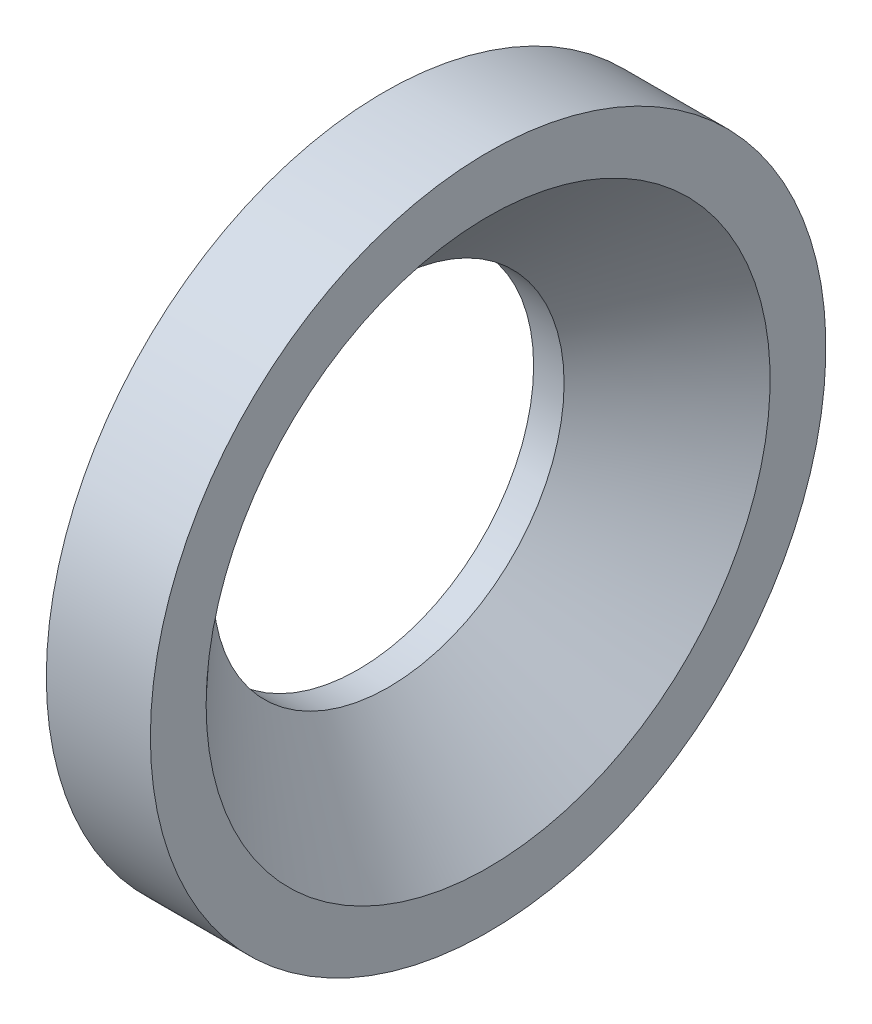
from build123d import *


with BuildPart() as part:
    # Sketch1 → Revolve1 (revolve)
    with BuildSketch(Plane.XY, mode=Mode.PRIVATE) as revolve1_sk:
        Polygon((0, 15), (2.6035, 15), (11.1125, 24.0919), (11.1125, 28.8544), (2.2225, 28.8544), (0, 18.81), align=None)
    revolve(revolve1_sk.sketch.rotate(Axis((-37.992486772, 0, 0), (1, 0, 0)), 90), axis=Axis((-37.992486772, 0, 0), (1, 0, 0)))


solid = part.part
